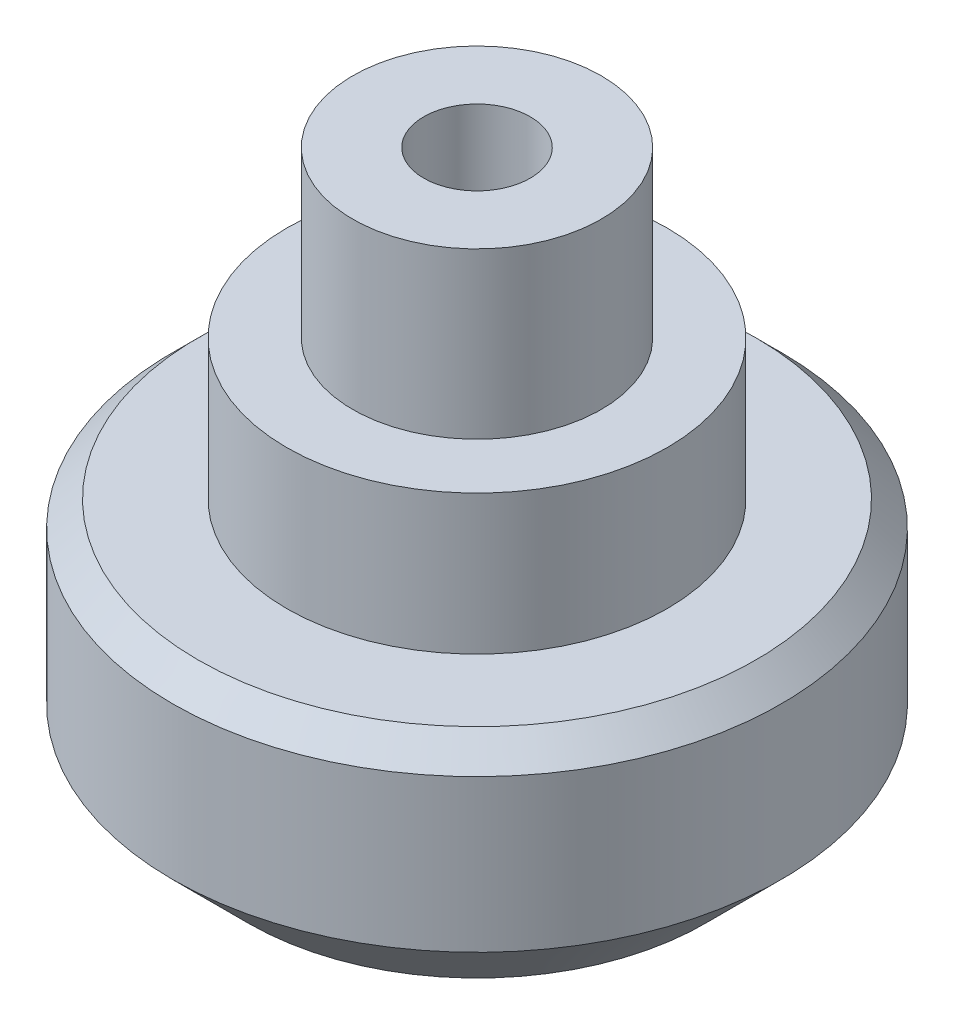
from build123d import *

# Parameters (mm, degrees)
SKETCH1_R      = 12
EXTRUDE1_DEPTH = 10
SKETCH2_R      = 7.5
EXTRUDE2_DEPTH = 5.5
SKETCH3_R      = 4.9
EXTRUDE3_DEPTH = 6.5
SKETCH4_R      = 2.1
EXTRUDE4_DEPTH = 12
SKETCH5_R      = 2.5
EXTRUDE5_DEPTH = 10
CHAMFER1_SIZE  = 1
CHAMFER2_SIZE  = 3


with BuildPart() as part:
    # Sketch1 → Extrude1 (new body)
    with BuildSketch(Plane(origin=(0, 0, 0), x_dir=(1, 0, 0), z_dir=(0, 1, 0))):
        with Locations(Location((0, 0, 0), (0, 0, 270))):
            Circle(SKETCH1_R)
    extrude(amount=EXTRUDE1_DEPTH)

    # Sketch2 → Extrude2 (add)
    with BuildSketch(Plane(origin=(0, 10, 0), x_dir=(1, 0, 0), z_dir=(0, 1, 0))):
        with Locations(Location((0, 0, 0), (0, 0, 270))):
            Circle(SKETCH2_R)
    extrude(amount=EXTRUDE2_DEPTH)

    # Sketch3 → Extrude3 (add)
    with BuildSketch(Plane(origin=(0, 15.5, 0), x_dir=(1, 0, 0), z_dir=(0, 1, 0))):
        with Locations(Location((0, 0, 0), (0, 0, 90))):
            Circle(SKETCH3_R)
    extrude(amount=EXTRUDE3_DEPTH)

    # Sketch4 → Extrude4 (cut)
    with BuildSketch(Plane(origin=(0, 22, 0), x_dir=(1, 0, 0), z_dir=(0, 1, 0))):
        with Locations(Location((0, 0, 0), (0, 0, 270))):
            Circle(SKETCH4_R)
    extrude(amount=-EXTRUDE4_DEPTH, mode=Mode.SUBTRACT)

    # Sketch5 → Extrude5 (cut)
    with BuildSketch(Plane.XZ):
        with Locations(Location((0, 0, 0), (0, 0, 270))):
            Circle(SKETCH5_R)
    extrude(amount=-EXTRUDE5_DEPTH, mode=Mode.SUBTRACT)

    # Chamfer1
    chamfer1_edges = [part.edges().sort_by_distance(p)[0] for p in [
        (0, 10, -12),
    ]]
    chamfer(chamfer1_edges, length=CHAMFER1_SIZE)

    # Chamfer2
    chamfer2_edges = [part.edges().sort_by_distance(p)[0] for p in [
        (0, 0, -12),
    ]]
    chamfer(chamfer2_edges, length=CHAMFER2_SIZE)


solid = part.part
